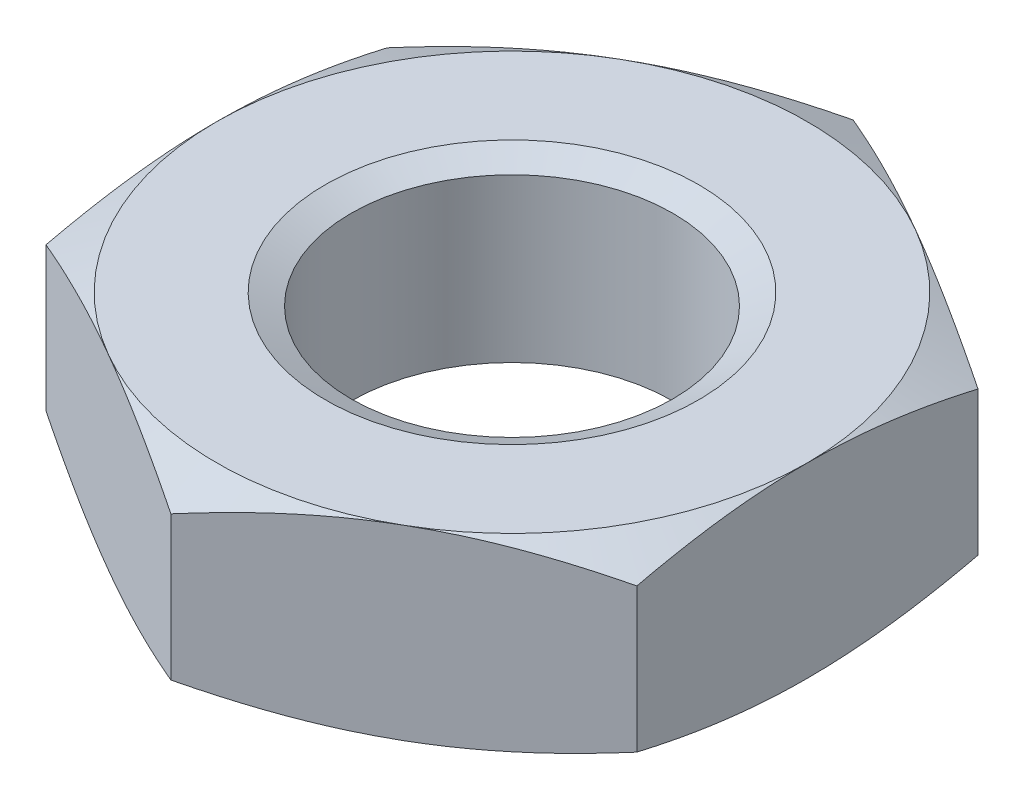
from build123d import *

# Parameters (mm, degrees)
EXTRUDE1_DEPTH = 3


with BuildPart() as part:
    # Sketch1 → Extrude1 (new, symmetric)
    with BuildSketch(Plane(origin=(0, 0, 0), x_dir=(1, 0, 0), z_dir=(0, 1, 0))):
        Polygon((0, 10.969655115), (-9.5, 5.484827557), (-9.5, -5.484827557), (0, -10.969655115), (9.5, -5.484827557), (9.5, 5.484827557), align=None)
    extrude(amount=EXTRUDE1_DEPTH, both=True)

    # Sketch4 → Cut-Revolve2 (revolve, cut)
    with BuildSketch(Plane(origin=(0, 0, 0), x_dir=(0, 0, -1), z_dir=(1, 0, 0))):
        Polygon((0, 3), (6, 3), (5.1731842, 2.614449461), (5.1731842, -2.614449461), (6, -3), (0, -3), align=None)
    revolve(axis=Axis((0, 3, 0), (0, 1, 0)), mode=Mode.SUBTRACT)

    # Sketch5 → Cut-Revolve3 (revolve, cut)
    with BuildSketch(Plane(origin=(0, 0, 0), x_dir=(0, 0, -1), z_dir=(1, 0, 0))):
        Polygon((0, -3), (9.5, -3), (10.969655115, -2.314688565), (10.969655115, 2.314688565), (9.5, 3), (0, 3), (0, 4.27), (12.239655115, 4.27), (12.239655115, -4.27), (0, -4.27), align=None)
    revolve(axis=Axis((0, -3, 0), (0, 1, 0)), mode=Mode.SUBTRACT)


solid = part.part
